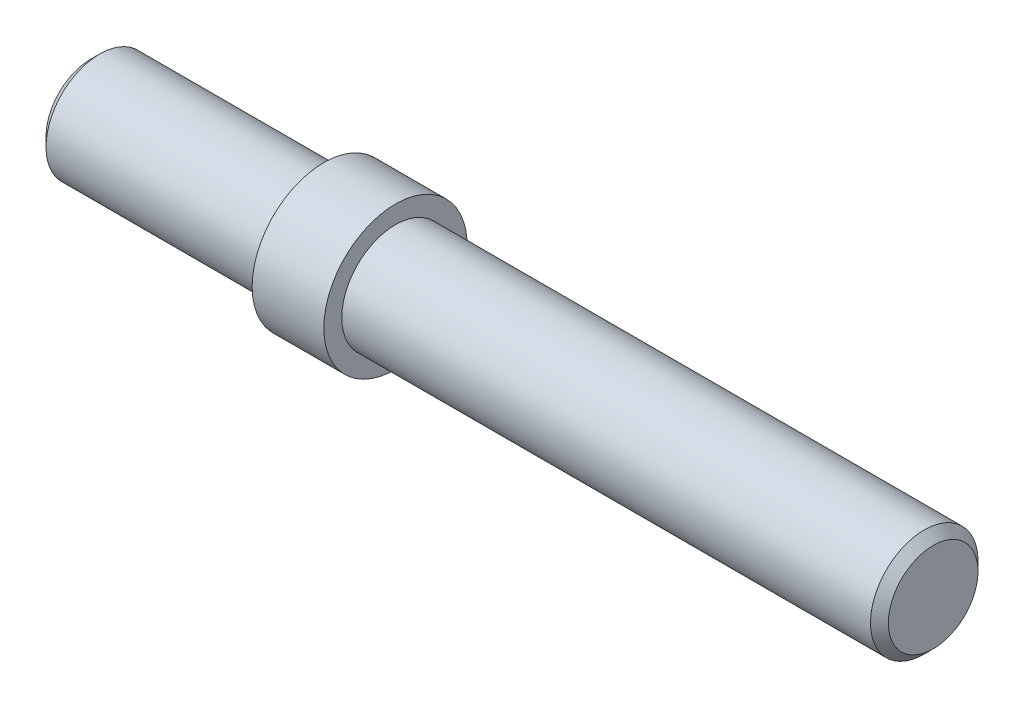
from build123d import *

# Parameters (mm, degrees)
CHANFREIN1_SIZE = 0.5


with BuildPart() as part:
    # Esquisse1 → Base-R_volution (revolve)
    with BuildSketch(Plane.XY, mode=Mode.PRIVATE) as base_r_volution_sk:
        Polygon((0, 0), (0, 3), (13, 3), (13, 4), (17, 4), (17, 3), (47, 3), (47, 0), align=None)
    revolve(base_r_volution_sk.sketch.rotate(Axis((0, 0, 0), (1, 0, 0)), 90), axis=Axis((0, 0, 0), (1, 0, 0)))

    # Chanfrein1
    chanfrein1_edges = [part.edges().sort_by_distance(p)[0] for p in [
        (0, 0, -3),
        (47, 0, -3),
    ]]
    chamfer(chanfrein1_edges, length=CHANFREIN1_SIZE)


solid = part.part
